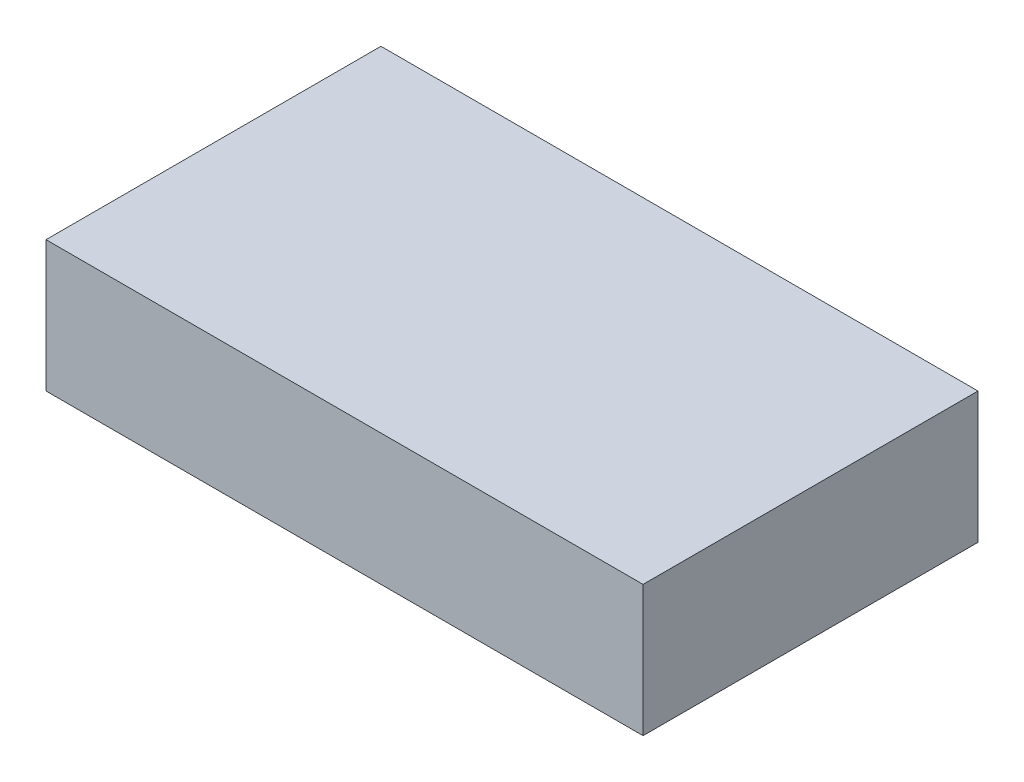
ISO-10303-21;
HEADER;
FILE_DESCRIPTION(('STEP AP214'),'2;1');
FILE_NAME('part.step','',(''),(''),'','','');
FILE_SCHEMA(('AUTOMOTIVE_DESIGN { 1 0 10303 214 1 1 1 1 }'));
ENDSEC;
DATA;
#1=APPLICATION_CONTEXT('core data for automotive mechanical design processes');
#2=APPLICATION_PROTOCOL_DEFINITION('international standard','automotive_design',2000,#1);
#3=PRODUCT_CONTEXT('',#1,'mechanical');
#4=PRODUCT('Part','Part','',(#3));
#5=PRODUCT_RELATED_PRODUCT_CATEGORY('part','',(#4));
#6=PRODUCT_DEFINITION_FORMATION('','',#4);
#7=PRODUCT_DEFINITION_CONTEXT('part definition',#1,'design');
#8=PRODUCT_DEFINITION('design','',#6,#7);
#9=PRODUCT_DEFINITION_SHAPE('','',#8);
#10=(LENGTH_UNIT() NAMED_UNIT(*) SI_UNIT(.MILLI.,.METRE.));
#11=(NAMED_UNIT(*) PLANE_ANGLE_UNIT() SI_UNIT($,.RADIAN.));
#12=(NAMED_UNIT(*) SI_UNIT($,.STERADIAN.) SOLID_ANGLE_UNIT());
#13=UNCERTAINTY_MEASURE_WITH_UNIT(LENGTH_MEASURE(1.E-05),#10,'distance_accuracy_value','');
#14=(GEOMETRIC_REPRESENTATION_CONTEXT(3) GLOBAL_UNCERTAINTY_ASSIGNED_CONTEXT((#13)) GLOBAL_UNIT_ASSIGNED_CONTEXT((#10,
#11,#12)) REPRESENTATION_CONTEXT('',''));
#15=CARTESIAN_POINT('',(0.,0.,0.));
#16=DIRECTION('',(0.,0.,1.));
#17=DIRECTION('',(1.,0.,0.));
#18=AXIS2_PLACEMENT_3D('',#15,#16,#17);
#19=CARTESIAN_POINT('',(41.,18.,-23.));
#20=DIRECTION('',(-1.,0.,0.));
#21=DIRECTION('',(0.,0.,1.));
#22=AXIS2_PLACEMENT_3D('',#19,#20,#21);
#23=PLANE('',#22);
#24=DIRECTION('',(0.,0.,-1.));
#25=VECTOR('',#24,1.);
#26=CARTESIAN_POINT('',(41.,0.,-23.));
#27=LINE('',#26,#25);
#28=CARTESIAN_POINT('',(41.,0.,23.));
#29=VERTEX_POINT('',#28);
#30=CARTESIAN_POINT('',(41.,0.,-23.));
#31=VERTEX_POINT('',#30);
#32=EDGE_CURVE('E96',#29,#31,#27,.T.);
#33=ORIENTED_EDGE('',*,*,#32,.T.);
#34=DIRECTION('',(0.,-1.,0.));
#35=VECTOR('',#34,1.);
#36=CARTESIAN_POINT('',(41.,18.,-23.));
#37=LINE('',#36,#35);
#38=CARTESIAN_POINT('',(41.,18.,-23.));
#39=VERTEX_POINT('',#38);
#40=EDGE_CURVE('E11',#39,#31,#37,.T.);
#41=ORIENTED_EDGE('',*,*,#40,.F.);
#42=DIRECTION('',(0.,0.,-1.));
#43=VECTOR('',#42,1.);
#44=CARTESIAN_POINT('',(41.,18.,-23.));
#45=LINE('',#44,#43);
#46=CARTESIAN_POINT('',(41.,18.,23.));
#47=VERTEX_POINT('',#46);
#48=EDGE_CURVE('E84',#47,#39,#45,.T.);
#49=ORIENTED_EDGE('',*,*,#48,.F.);
#50=DIRECTION('',(0.,-1.,0.));
#51=VECTOR('',#50,1.);
#52=CARTESIAN_POINT('',(41.,18.,23.));
#53=LINE('',#52,#51);
#54=EDGE_CURVE('E92',#47,#29,#53,.T.);
#55=ORIENTED_EDGE('',*,*,#54,.T.);
#56=EDGE_LOOP('',(#33,#41,#49,#55));
#57=FACE_BOUND('',#56,.T.);
#58=ADVANCED_FACE('F33',(#57),#23,.F.);
#59=CARTESIAN_POINT('',(-41.,18.,-23.));
#60=DIRECTION('',(0.,0.,1.));
#61=DIRECTION('',(1.,0.,0.));
#62=AXIS2_PLACEMENT_3D('',#59,#60,#61);
#63=PLANE('',#62);
#64=DIRECTION('',(-1.,0.,0.));
#65=VECTOR('',#64,1.);
#66=CARTESIAN_POINT('',(-41.,0.,-23.));
#67=LINE('',#66,#65);
#68=CARTESIAN_POINT('',(-41.,0.,-23.));
#69=VERTEX_POINT('',#68);
#70=EDGE_CURVE('E88',#31,#69,#67,.T.);
#71=ORIENTED_EDGE('',*,*,#70,.T.);
#72=DIRECTION('',(0.,-1.,0.));
#73=VECTOR('',#72,1.);
#74=CARTESIAN_POINT('',(-41.,18.,-23.));
#75=LINE('',#74,#73);
#76=CARTESIAN_POINT('',(-41.,18.,-23.));
#77=VERTEX_POINT('',#76);
#78=EDGE_CURVE('E41',#77,#69,#75,.T.);
#79=ORIENTED_EDGE('',*,*,#78,.F.);
#80=DIRECTION('',(-1.,0.,0.));
#81=VECTOR('',#80,1.);
#82=CARTESIAN_POINT('',(-41.,18.,-23.));
#83=LINE('',#82,#81);
#84=EDGE_CURVE('E79',#39,#77,#83,.T.);
#85=ORIENTED_EDGE('',*,*,#84,.F.);
#86=ORIENTED_EDGE('',*,*,#40,.T.);
#87=EDGE_LOOP('',(#71,#79,#85,#86));
#88=FACE_BOUND('',#87,.T.);
#89=ADVANCED_FACE('F87',(#88),#63,.F.);
#90=CARTESIAN_POINT('',(-41.,18.,-23.));
#91=DIRECTION('',(1.,0.,0.));
#92=DIRECTION('',(0.,0.,-1.));
#93=AXIS2_PLACEMENT_3D('',#90,#91,#92);
#94=PLANE('',#93);
#95=DIRECTION('',(0.,0.,1.));
#96=VECTOR('',#95,1.);
#97=CARTESIAN_POINT('',(-41.,0.,-23.));
#98=LINE('',#97,#96);
#99=CARTESIAN_POINT('',(-41.,0.,23.));
#100=VERTEX_POINT('',#99);
#101=EDGE_CURVE('E66',#69,#100,#98,.T.);
#102=ORIENTED_EDGE('',*,*,#101,.T.);
#103=DIRECTION('',(0.,-1.,0.));
#104=VECTOR('',#103,1.);
#105=CARTESIAN_POINT('',(-41.,18.,23.));
#106=LINE('',#105,#104);
#107=CARTESIAN_POINT('',(-41.,18.,23.));
#108=VERTEX_POINT('',#107);
#109=EDGE_CURVE('E89',#108,#100,#106,.T.);
#110=ORIENTED_EDGE('',*,*,#109,.F.);
#111=DIRECTION('',(0.,0.,1.));
#112=VECTOR('',#111,1.);
#113=CARTESIAN_POINT('',(-41.,18.,-23.));
#114=LINE('',#113,#112);
#115=EDGE_CURVE('E82',#77,#108,#114,.T.);
#116=ORIENTED_EDGE('',*,*,#115,.F.);
#117=ORIENTED_EDGE('',*,*,#78,.T.);
#118=EDGE_LOOP('',(#102,#110,#116,#117));
#119=FACE_BOUND('',#118,.T.);
#120=ADVANCED_FACE('F90',(#119),#94,.F.);
#121=CARTESIAN_POINT('',(-41.,18.,23.));
#122=DIRECTION('',(0.,0.,-1.));
#123=DIRECTION('',(-1.,0.,0.));
#124=AXIS2_PLACEMENT_3D('',#121,#122,#123);
#125=PLANE('',#124);
#126=DIRECTION('',(1.,0.,0.));
#127=VECTOR('',#126,1.);
#128=CARTESIAN_POINT('',(-41.,0.,23.));
#129=LINE('',#128,#127);
#130=EDGE_CURVE('E72',#100,#29,#129,.T.);
#131=ORIENTED_EDGE('',*,*,#130,.T.);
#132=ORIENTED_EDGE('',*,*,#54,.F.);
#133=DIRECTION('',(1.,0.,0.));
#134=VECTOR('',#133,1.);
#135=CARTESIAN_POINT('',(-41.,18.,23.));
#136=LINE('',#135,#134);
#137=EDGE_CURVE('E49',#108,#47,#136,.T.);
#138=ORIENTED_EDGE('',*,*,#137,.F.);
#139=ORIENTED_EDGE('',*,*,#109,.T.);
#140=EDGE_LOOP('',(#131,#132,#138,#139));
#141=FACE_BOUND('',#140,.T.);
#142=ADVANCED_FACE('F103',(#141),#125,.F.);
#143=CARTESIAN_POINT('',(0.,18.,0.));
#144=DIRECTION('',(0.,1.,0.));
#145=DIRECTION('',(0.,0.,1.));
#146=AXIS2_PLACEMENT_3D('',#143,#144,#145);
#147=PLANE('',#146);
#148=ORIENTED_EDGE('',*,*,#48,.T.);
#149=ORIENTED_EDGE('',*,*,#84,.T.);
#150=ORIENTED_EDGE('',*,*,#115,.T.);
#151=ORIENTED_EDGE('',*,*,#137,.T.);
#152=EDGE_LOOP('',(#148,#149,#150,#151));
#153=FACE_BOUND('',#152,.T.);
#154=ADVANCED_FACE('F80',(#153),#147,.T.);
#155=CARTESIAN_POINT('',(0.,0.,0.));
#156=DIRECTION('',(0.,1.,0.));
#157=DIRECTION('',(0.,0.,1.));
#158=AXIS2_PLACEMENT_3D('',#155,#156,#157);
#159=PLANE('',#158);
#160=ORIENTED_EDGE('',*,*,#32,.F.);
#161=ORIENTED_EDGE('',*,*,#130,.F.);
#162=ORIENTED_EDGE('',*,*,#101,.F.);
#163=ORIENTED_EDGE('',*,*,#70,.F.);
#164=EDGE_LOOP('',(#160,#161,#162,#163));
#165=FACE_BOUND('',#164,.T.);
#166=ADVANCED_FACE('F106',(#165),#159,.F.);
#167=CLOSED_SHELL('',(#58,#89,#120,#142,#154,#166));
#168=MANIFOLD_SOLID_BREP('B2',#167);
#169=ADVANCED_BREP_SHAPE_REPRESENTATION('',(#18,#168),#14);
#170=SHAPE_DEFINITION_REPRESENTATION(#9,#169);
ENDSEC;
END-ISO-10303-21;
